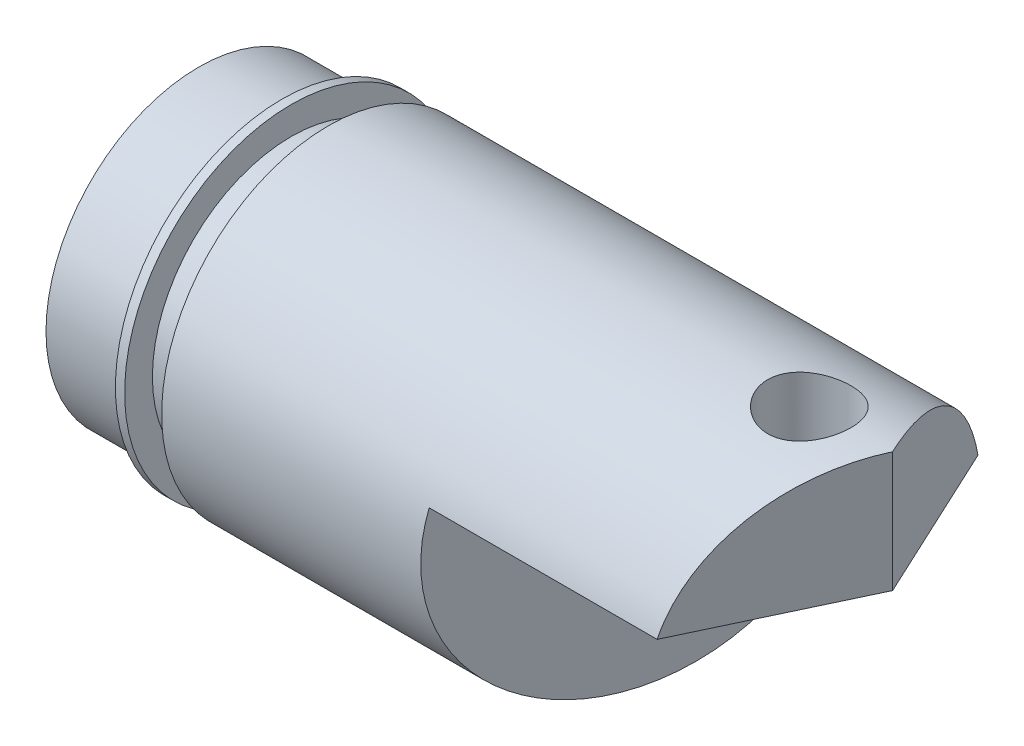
from build123d import *

# Parameters (mm, degrees)
ENL_V_MAT_EXTRU_3_DEPTH = 161.972047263
ESQUISSE8_R             = 9
ENL_V_MAT_EXTRU_4_DEPTH = 161.972047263


with BuildPart() as part:
    # Esquisse6 → R_volution1 (revolve)
    with BuildSketch(Plane.XY):
        with BuildLine():
            Line((0, 21), (0, 33))
            Line((0, 33), (18, 33))
            Line((18, 33), (18, 36))
            Line((18, 36), (20, 36))
            Line((20, 36), (20, 30))
            Line((20, 30), (28, 30))
            Line((28, 30), (28, 36))
            Line((28, 36), (150, 36))
            Line((150, 36), (150, 0))
            Line((150, 0), (80.999999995, 0))
            ThreePointArc((80.999999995, 0), (77.265560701, 9.903895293), (67.921714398, 14.876391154))
            Line((67.921714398, 14.876391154), (36, 19))
            Line((36, 19), (36, 21))
            Line((36, 21), (0, 21))
        make_face()
    revolve(axis=Axis((150, 0, 0), (-1, 0, 0)))

    # Esquisse7 → Enl_v. mat.-Extru.3 (cut, through all)
    with BuildSketch(Plane(origin=(0, 10, 0), x_dir=(1, 0, 0), z_dir=(0, 1, 0))):
        Polygon((105, 36), (84, -36), (150, -36), (150, 36), align=None)
    extrude(amount=-ENL_V_MAT_EXTRU_3_DEPTH, mode=Mode.SUBTRACT)

    # Esquisse8 → Enl_v. mat.-Extru.4 (cut, through all)
    with BuildSketch(Plane(origin=(0, 10, 0), x_dir=(-1, 0, 0), z_dir=(0, 1, 0))):
        with Locations(Location((-132, 0, 0), (0, 0, 180))):
            Circle(ESQUISSE8_R)
        Polygon((-130.288986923, -42.270403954), (-160.663521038, -42.270403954), (-160.663521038, 48.483793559), (-127.12534153, 48.483793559), (-150, 0), align=None)
    extrude(amount=ENL_V_MAT_EXTRU_4_DEPTH, mode=Mode.SUBTRACT)


solid = part.part
